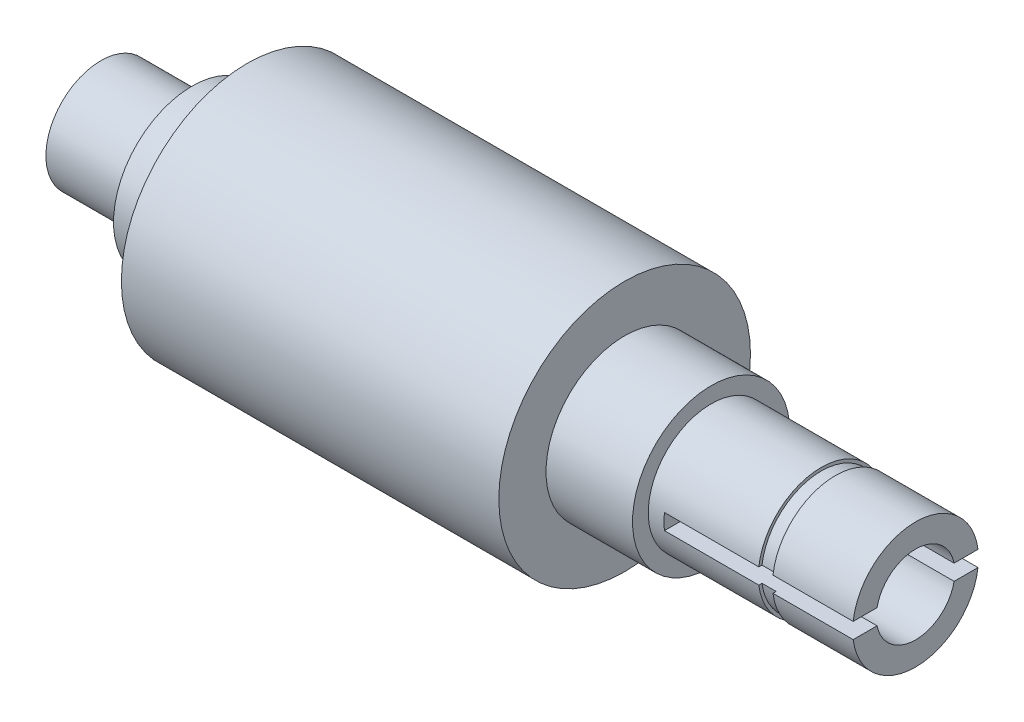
from build123d import *

# Parameters (mm, degrees)
ESQUISSE2_W                     = 12
ESQUISSE2_H                     = 1
ENL_V_MAT_EXTRU_1_DEPTH         = 10
TROU_TARAUD_M5X0_81_D           = 4.2
TROU_TARAUD_M5X0_81_DEPTH       = 12.4
TROU_TARAUD_M5X0_81_CSINK_D     = 5
TROU_TARAUD_M5X0_81_CSINK_ANGLE = 90
TROU_TARAUD_M5X0_81_TIP         = 1.212435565
ESQUISSE5_R                     = 4
ESQUISSE5_R_2                   = 3.8
ENL_V_MAT_EXTRU_2_DEPTH         = 0.9


with BuildPart() as part:
    # Esquisse1 → R_volution1 (revolve)
    with BuildSketch(Plane.XY, mode=Mode.PRIVATE) as r_volution1_sk:
        Polygon((0, 2.5), (0, 4), (-13, 4), (-13, 5), (-18.5, 5), (-18.5, 8), (-42.5, 8), (-42.5, 5), (-46, 5), (-46, 3.5), (-51.8, 3.5), (-51.8, 0), (-16.443375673, 0), (-15, 2.5), align=None)
    revolve(r_volution1_sk.sketch.rotate(Axis((0, 0, 0), (-1, 0, 0)), 90), axis=Axis((0, 0, 0), (-1, 0, 0)))

    # Esquisse2 → Enl_v. mat.-Extru.1 (cut, symmetric)
    with BuildSketch(Plane.XY):
        with Locations((-6, 0)):
            Rectangle(ESQUISSE2_W, ESQUISSE2_H)
    extrude(amount=ENL_V_MAT_EXTRU_1_DEPTH, both=True, mode=Mode.SUBTRACT)

    # Trou taraud_ M5x0.81
    with Locations(Plane.ZY.offset(51.8)):
        with Locations((0, 0)):
            CounterSinkHole(TROU_TARAUD_M5X0_81_D / 2, TROU_TARAUD_M5X0_81_CSINK_D / 2, depth=TROU_TARAUD_M5X0_81_DEPTH, counter_sink_angle=TROU_TARAUD_M5X0_81_CSINK_ANGLE)
            with Locations((0, 0, -(TROU_TARAUD_M5X0_81_DEPTH + TROU_TARAUD_M5X0_81_TIP / 2))):  # 120° drill point
                Cone(0, TROU_TARAUD_M5X0_81_D / 2, TROU_TARAUD_M5X0_81_TIP, mode=Mode.SUBTRACT)

    # Esquisse5 → Enl_v. mat.-Extru.2 (cut)
    with BuildSketch(Plane(origin=(-6, 0, 0), x_dir=(0, 0, -1), z_dir=(1, 0, 0))):
        Circle(ESQUISSE5_R)
        Circle(ESQUISSE5_R_2, mode=Mode.SUBTRACT)
    extrude(amount=ENL_V_MAT_EXTRU_2_DEPTH, mode=Mode.SUBTRACT)


solid = part.part
